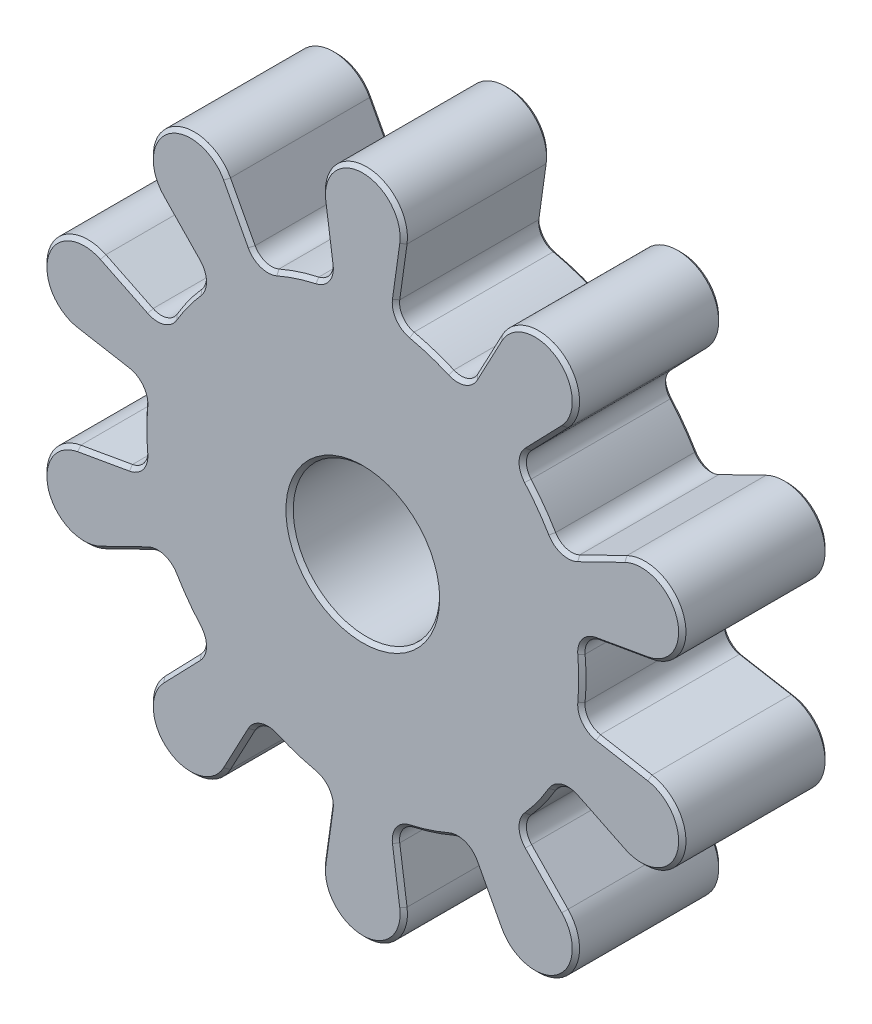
from build123d import *

# Parameters (mm, degrees)
SKETCH_1_R      = 5
EXTRUDE_1_DEPTH = 10
CHAMFER_1_SIZE  = 0.25


with BuildPart() as part:
    # Sketch 1 → Extrude 1 (new body)
    with BuildSketch(Plane.XY):
        with BuildLine():
            Line((7.599782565, 14.328339), (9.283451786, 17.494860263))
            ThreePointArc((9.283451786, 17.494860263), (13.401503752, 18.445587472), (13.769856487, 14.23529645))
            Line((13.769856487, 14.23529645), (11.278598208, 11.655522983))
            ThreePointArc((11.278598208, 11.655522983), (10.922470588, 10.801403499), (11.240466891, 9.932366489))
            ThreePointArc((11.240466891, 9.932366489), (12.135254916, 8.816778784), (12.919737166, 7.621049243))
            ThreePointArc((12.919737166, 7.621049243), (13.647974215, 7.050069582), (14.570339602, 7.12482964))
            Line((14.570339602, 7.12482964), (17.793691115, 8.696963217))
            ThreePointArc((17.793691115, 8.696963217), (21.684088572, 7.045587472), (19.507345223, 3.422878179))
            Line((19.507345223, 3.422878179), (15.97552214, 2.800122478))
            ThreePointArc((15.97552214, 2.800122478), (15.185370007, 2.318451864), (14.931827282, 1.428472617))
            ThreePointArc((14.931827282, 1.428472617), (15, 0), (14.931827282, -1.428472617))
            ThreePointArc((14.931827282, -1.428472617), (15.185370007, -2.318451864), (15.97552214, -2.800122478))
            Line((15.97552214, -2.800122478), (19.507345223, -3.422878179))
            ThreePointArc((19.507345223, -3.422878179), (21.684088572, -7.045587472), (17.793691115, -8.696963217))
            Line((17.793691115, -8.696963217), (14.570339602, -7.12482964))
            ThreePointArc((14.570339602, -7.12482964), (13.647974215, -7.050069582), (12.919737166, -7.621049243))
            ThreePointArc((12.919737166, -7.621049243), (12.135254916, -8.816778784), (11.240466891, -9.932366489))
            ThreePointArc((11.240466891, -9.932366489), (10.922470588, -10.801403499), (11.278598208, -11.655522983))
            Line((11.278598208, -11.655522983), (13.769856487, -14.23529645))
            ThreePointArc((13.769856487, -14.23529645), (13.401503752, -18.445587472), (9.283451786, -17.494860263))
            Line((9.283451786, -17.494860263), (7.599782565, -14.328339))
            ThreePointArc((7.599782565, -14.328339), (6.897516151, -13.725704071), (5.972746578, -13.759589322))
            ThreePointArc((5.972746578, -13.759589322), (4.635254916, -14.265847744), (3.255630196, -14.642433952))
            ThreePointArc((3.255630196, -14.642433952), (2.487558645, -15.158586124), (2.273633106, -16.058909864))
            Line((2.273633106, -16.058909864), (2.772750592, -19.610315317))
            ThreePointArc((2.772750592, -19.610315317), (0, -22.8), (-2.772750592, -19.610315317))
            Line((-2.772750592, -19.610315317), (-2.273633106, -16.058909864))
            ThreePointArc((-2.273633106, -16.058909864), (-2.487558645, -15.158586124), (-3.255630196, -14.642433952))
            ThreePointArc((-3.255630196, -14.642433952), (-4.635254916, -14.265847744), (-5.972746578, -13.759589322))
            ThreePointArc((-5.972746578, -13.759589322), (-6.897516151, -13.725704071), (-7.599782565, -14.328339))
            Line((-7.599782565, -14.328339), (-9.283451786, -17.494860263))
            ThreePointArc((-9.283451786, -17.494860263), (-13.401503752, -18.445587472), (-13.769856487, -14.23529645))
            Line((-13.769856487, -14.23529645), (-11.278598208, -11.655522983))
            ThreePointArc((-11.278598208, -11.655522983), (-10.922470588, -10.801403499), (-11.240466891, -9.932366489))
            ThreePointArc((-11.240466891, -9.932366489), (-12.135254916, -8.816778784), (-12.919737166, -7.621049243))
            ThreePointArc((-12.919737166, -7.621049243), (-13.647974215, -7.050069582), (-14.570339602, -7.12482964))
            Line((-14.570339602, -7.12482964), (-17.793691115, -8.696963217))
            ThreePointArc((-17.793691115, -8.696963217), (-21.684088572, -7.045587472), (-19.507345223, -3.422878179))
            Line((-19.507345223, -3.422878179), (-15.97552214, -2.800122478))
            ThreePointArc((-15.97552214, -2.800122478), (-15.185370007, -2.318451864), (-14.931827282, -1.428472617))
            ThreePointArc((-14.931827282, -1.428472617), (-15, 0), (-14.931827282, 1.428472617))
            ThreePointArc((-14.931827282, 1.428472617), (-15.185370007, 2.318451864), (-15.97552214, 2.800122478))
            Line((-15.97552214, 2.800122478), (-19.507345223, 3.422878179))
            ThreePointArc((-19.507345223, 3.422878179), (-21.684088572, 7.045587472), (-17.793691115, 8.696963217))
            Line((-17.793691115, 8.696963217), (-14.570339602, 7.12482964))
            ThreePointArc((-14.570339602, 7.12482964), (-13.647974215, 7.050069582), (-12.919737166, 7.621049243))
            ThreePointArc((-12.919737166, 7.621049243), (-12.135254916, 8.816778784), (-11.240466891, 9.932366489))
            ThreePointArc((-11.240466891, 9.932366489), (-10.922470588, 10.801403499), (-11.278598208, 11.655522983))
            Line((-11.278598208, 11.655522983), (-13.769856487, 14.23529645))
            ThreePointArc((-13.769856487, 14.23529645), (-13.401503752, 18.445587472), (-9.283451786, 17.494860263))
            Line((-9.283451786, 17.494860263), (-7.599782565, 14.328339))
            ThreePointArc((-7.599782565, 14.328339), (-6.897516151, 13.725704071), (-5.972746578, 13.759589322))
            ThreePointArc((-5.972746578, 13.759589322), (-4.635254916, 14.265847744), (-3.255630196, 14.642433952))
            ThreePointArc((-3.255630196, 14.642433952), (-2.487558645, 15.158586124), (-2.273633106, 16.058909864))
            Line((-2.273633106, 16.058909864), (-2.772750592, 19.610315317))
            ThreePointArc((-2.772750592, 19.610315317), (0, 22.8), (2.772750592, 19.610315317))
            Line((2.772750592, 19.610315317), (2.273633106, 16.058909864))
            ThreePointArc((2.273633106, 16.058909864), (2.487558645, 15.158586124), (3.255630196, 14.642433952))
            ThreePointArc((3.255630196, 14.642433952), (4.635254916, 14.265847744), (5.972746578, 13.759589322))
            ThreePointArc((5.972746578, 13.759589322), (6.897516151, 13.725704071), (7.599782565, 14.328339))
        make_face()
        Circle(SKETCH_1_R, mode=Mode.SUBTRACT)
    extrude(amount=EXTRUDE_1_DEPTH)

    # Chamfer 1
    chamfer_1_edges = [part.edges().sort_by_distance(p)[0] for p in [
        (0, 22.8, 10),
        (0, -22.8, 10),
        (2.523191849, -17.834612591, 10),
        (2.487558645, -15.158586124, 10),
        (4.635254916, -14.265847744, 10),
        (6.897516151, -13.725704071, 10),
        (8.441617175, -15.911599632, 10),
        (13.401503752, -18.445587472, 10),
        (12.524227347, -12.945409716, 10),
        (10.922470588, -10.801403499, 10),
        (12.135254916, -8.816778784, 10),
        (-2.523191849, 17.834612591, 10),
        (13.647974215, -7.050069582, 10),
        (16.182015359, -7.910896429, 10),
        (-5, 0, 0),
        (-5, 0, 10),
        (21.684088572, -7.045587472, 10),
        (17.741433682, -3.111500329, 10),
        (15.185370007, -2.318451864, 10),
        (15, 0, 10),
        (15.185370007, 2.318451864, 10),
        (17.741433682, 3.111500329, 10),
        (21.684088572, 7.045587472, 10),
        (16.182015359, 7.910896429, 10),
        (-2.487558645, 15.158586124, 10),
        (13.647974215, 7.050069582, 10),
        (12.135254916, 8.816778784, 10),
        (10.922470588, 10.801403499, 10),
        (12.524227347, 12.945409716, 10),
        (13.401503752, 18.445587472, 10),
        (8.441617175, 15.911599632, 10),
        (6.897516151, 13.725704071, 10),
        (4.635254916, 14.265847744, 10),
        (-4.635254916, 14.265847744, 10),
        (-6.897516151, 13.725704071, 10),
        (-8.441617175, 15.911599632, 10),
        (-13.401503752, 18.445587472, 10),
        (-12.524227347, 12.945409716, 10),
        (-10.922470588, 10.801403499, 10),
        (-12.135254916, 8.816778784, 10),
        (2.487558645, 15.158586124, 10),
        (-13.647974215, 7.050069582, 10),
        (-16.182015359, 7.910896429, 10),
        (-21.684088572, 7.045587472, 10),
        (-17.741433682, 3.111500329, 10),
        (4.635254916, 14.265847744, 0),
        (6.897516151, 13.725704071, 0),
        (8.441617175, 15.911599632, 0),
        (13.401503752, 18.445587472, 0),
        (12.524227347, 12.945409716, 0),
        (10.922470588, 10.801403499, 0),
        (12.135254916, 8.816778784, 0),
        (-15.185370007, 2.318451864, 10),
        (13.647974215, 7.050069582, 0),
        (16.182015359, 7.910896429, 0),
        (21.684088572, 7.045587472, 0),
        (17.741433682, 3.111500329, 0),
        (15.185370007, 2.318451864, 0),
        (15, 0, 0),
        (15.185370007, -2.318451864, 0),
        (17.741433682, -3.111500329, 0),
        (-15, 0, 10),
        (21.684088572, -7.045587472, 0),
        (16.182015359, -7.910896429, 0),
        (13.647974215, -7.050069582, 0),
        (12.135254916, -8.816778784, 0),
        (10.922470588, -10.801403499, 0),
        (12.524227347, -12.945409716, 0),
        (13.401503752, -18.445587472, 0),
        (-15.185370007, -2.318451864, 10),
        (8.441617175, -15.911599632, 0),
        (6.897516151, -13.725704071, 0),
        (4.635254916, -14.265847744, 0),
        (2.487558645, -15.158586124, 0),
        (2.523191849, -17.834612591, 0),
        (0, -22.8, 0),
        (-2.523191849, -17.834612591, 0),
        (-2.487558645, -15.158586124, 0),
        (-17.741433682, -3.111500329, 10),
        (-4.635254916, -14.265847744, 0),
        (-6.897516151, -13.725704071, 0),
        (-8.441617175, -15.911599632, 0),
        (-13.401503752, -18.445587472, 0),
        (-12.524227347, -12.945409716, 0),
        (-10.922470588, -10.801403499, 0),
        (-12.135254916, -8.816778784, 0),
        (-21.684088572, -7.045587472, 10),
        (-13.647974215, -7.050069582, 0),
        (-16.182015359, -7.910896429, 0),
        (-21.684088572, -7.045587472, 0),
        (-17.741433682, -3.111500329, 0),
        (-15.185370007, -2.318451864, 0),
        (-15, 0, 0),
        (-15.185370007, 2.318451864, 0),
        (-17.741433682, 3.111500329, 0),
        (-16.182015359, -7.910896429, 10),
        (-21.684088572, 7.045587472, 0),
        (-16.182015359, 7.910896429, 0),
        (-13.647974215, 7.050069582, 0),
        (-12.135254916, 8.816778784, 0),
        (-10.922470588, 10.801403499, 0),
        (-12.524227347, 12.945409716, 0),
        (-13.401503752, 18.445587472, 0),
        (2.523191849, 17.834612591, 10),
        (-13.647974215, -7.050069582, 10),
        (-8.441617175, 15.911599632, 0),
        (-6.897516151, 13.725704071, 0),
        (-4.635254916, 14.265847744, 0),
        (-2.487558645, 15.158586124, 0),
        (-2.523191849, 17.834612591, 0),
        (0, 22.8, 0),
        (2.523191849, 17.834612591, 0),
        (2.487558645, 15.158586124, 0),
        (-12.135254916, -8.816778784, 10),
        (-10.922470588, -10.801403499, 10),
        (-12.524227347, -12.945409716, 10),
        (-13.401503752, -18.445587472, 10),
        (-8.441617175, -15.911599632, 10),
        (-6.897516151, -13.725704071, 10),
        (-4.635254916, -14.265847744, 10),
        (-2.487558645, -15.158586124, 10),
        (-2.523191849, -17.834612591, 10),
    ]]
    chamfer(chamfer_1_edges, length=CHAMFER_1_SIZE)


solid = part.part
